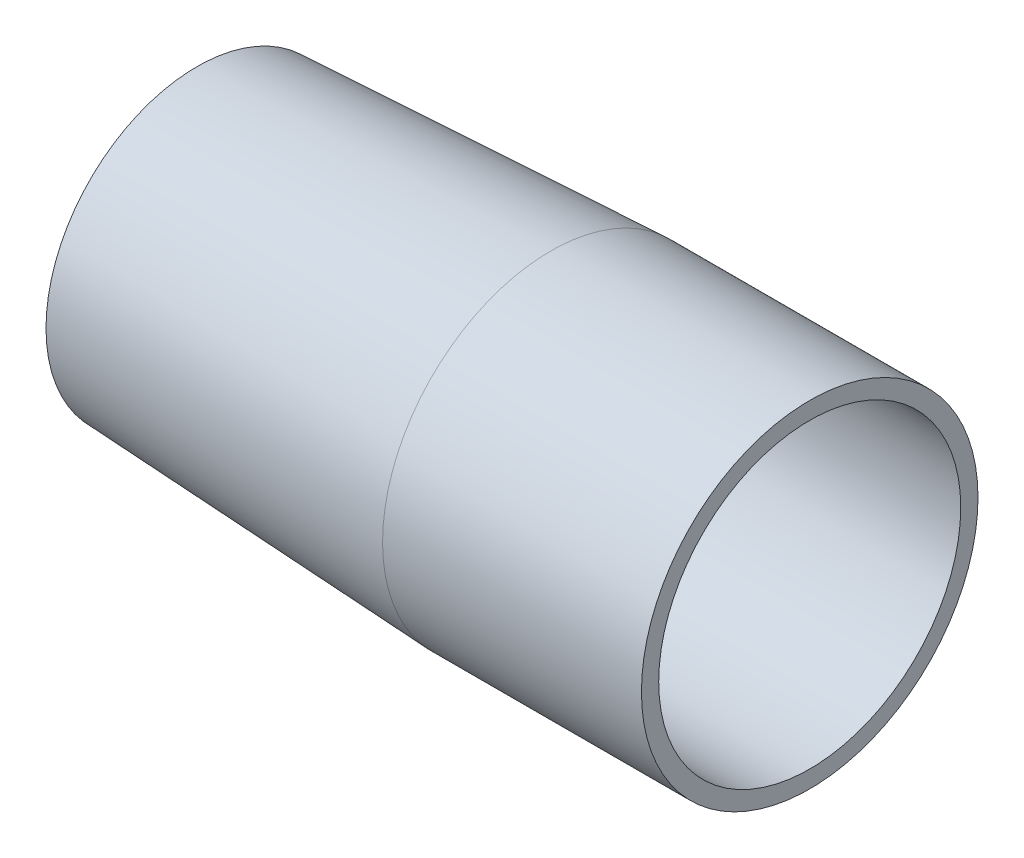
from build123d import *

# Parameters (mm, degrees)
BOSS_EXTRU_1_DEPTH           = 2
R_P_TITION_CIRCULAIRE1_COUNT = 3


with BuildPart() as part:
    # Esquisse1 → Base-R_volution (revolve)
    with BuildSketch(Plane.XY, mode=Mode.PRIVATE) as base_r_volution_sk:
        Polygon((-71, -15.5), (-71, -17.5), (-30, -19.5), (0, -19.5), (0, -17.5), (-30, -17.5), align=None)
    revolve(base_r_volution_sk.sketch.rotate(Axis((-49, 0, 0), (1, 0, 0)), 270), axis=Axis((-49, 0, 0), (1, 0, 0)))

    # Esquisse2 → Boss.-Extru.1 (add)
    with BuildSketch(Plane.ZY.offset(71)):
        with BuildLine():
            Line((-1.5, 14.435595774), (1.5, 14.435595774))
            Line((1.5, 14.435595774), (1.5, 17.435595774))
            ThreePointArc((1.5, 17.435595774), (0, 17.5), (-1.5, 17.435595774))
            Line((-1.5, 17.435595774), (-1.5, 14.435595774))
        make_face()
    boss_extru_1 = extrude(amount=-BOSS_EXTRU_1_DEPTH)

    # R_p_tition circulaire1: Boss.-Extru.1 ×3 about axis
    r_p_tition_circulaire1_axis = Axis((20, 0, 0), (-1, 0, 0))
    for i in range(1, R_P_TITION_CIRCULAIRE1_COUNT):
        add(boss_extru_1.rotate(r_p_tition_circulaire1_axis, i * 360 / R_P_TITION_CIRCULAIRE1_COUNT))


solid = part.part
